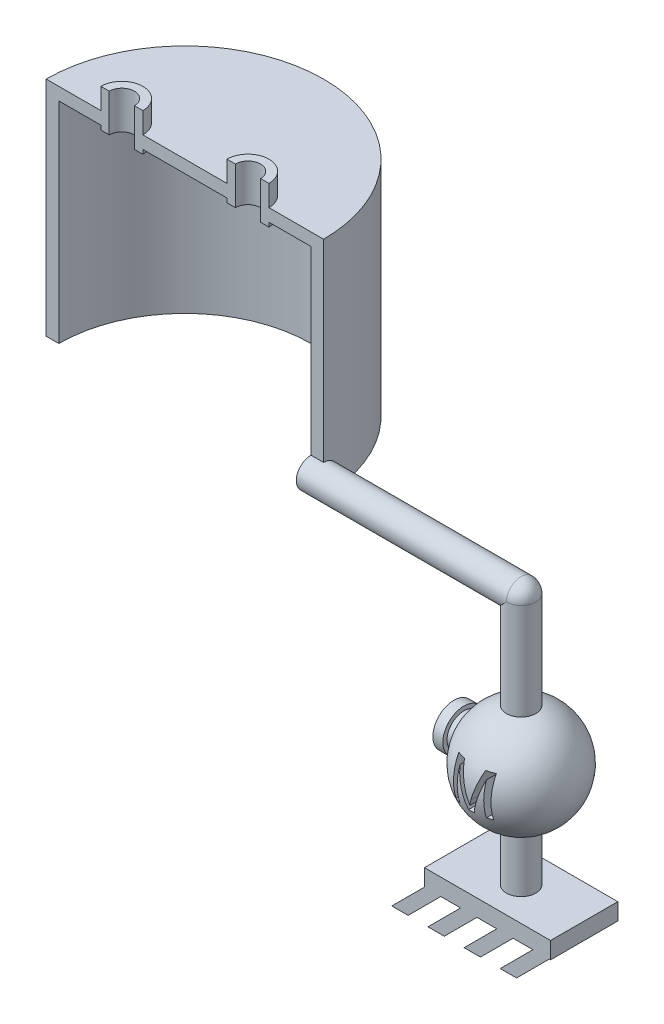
from build123d import *

# Parameters (mm, degrees)
ENL_V_MAT_EXTRU_1_DEPTH = 16.127679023
ESQUISSE3_R             = 3.5
EXTRUSION1_DEPTH        = 25
EXTRUSION2_START        = 35
ESQUISSE4_R             = 3.5
EXTRUSION2_DEPTH        = 35
ESQUISSE5_R             = 3.5
EXTRUSION3_DEPTH        = 50
R_VOLUTION3_ANGLE       = 180
EXTRUSION4_DEPTH        = 5
EXTRUSION4_DEPTH_BACK   = 4
ESQUISSE9_R             = 3
ENL_V_MAT_EXTRU_2_DEPTH = 17
ESQUISSE10_W            = 30
ESQUISSE10_H            = 16
EXTRUSION5_DEPTH        = 4
EXTRUSION6_DEPTH        = 16


with BuildPart() as part:
    # Esquisse1 → R_volution1 (revolve)
    with BuildSketch(Plane.XY, mode=Mode.PRIVATE) as r_volution1_sk:
        with BuildLine():
            Line((-11.842719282, 4), (-13.623944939, 4))
            Line((-13.623944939, 4), (-13.623944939, 5))
            Line((-13.623944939, 5), (-16, 5))
            Line((-16, 5), (-16, 0))
            Line((-16, 0), (12.5, 0))
            ThreePointArc((12.5, 0), (2.026821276, 12.33458534), (-11.842719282, 4))
        make_face()
    revolve(r_volution1_sk.sketch.rotate(Axis((16.096494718, 0, 0), (-1, 0, 0)), 90), axis=Axis((16.096494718, 0, 0), (-1, 0, 0)))

    # Esquisse2 → Enl_v. mat.-Extru.1 (cut)
    with BuildSketch(Plane.XY):
        with BuildLine():
            Line((-4.401688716, -3.923496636), (-4.401688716, 5.32245063))
            Line((-4.401688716, 5.32245063), (-2.440258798, 5.32245063))
            Line((-2.440258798, 5.32245063), (-0.373256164, -1.165640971))
            add(Edge.make_bspline(
                [(-0.373256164, -1.165640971), (-0.350508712, -1.239139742), (-0.306516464, -1.381282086), (-0.24128118, -1.58654871), (-0.181928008, -1.777298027), (-0.12847113, -1.954137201), (-0.078023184, -2.116188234), (-0.034343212, -2.264780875), (0.007416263, -2.398263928), (0.031889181, -2.483096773), (0.043478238, -2.523269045)],
                knots=[0, 0, 0, 0, 1.300204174, 2.514519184, 3.639827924, 4.676153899, 5.636536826, 6.507959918, 7.293450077, 8, 8, 8, 8], degree=3))
            add(Edge.make_bspline(
                [(0.043478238, -2.523269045), (0.056385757, -2.479417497), (0.083853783, -2.3860986), (0.128383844, -2.239370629), (0.175765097, -2.07699962), (0.232465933, -1.901776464), (0.291569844, -1.71095246), (0.353607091, -1.504686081), (0.425165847, -1.28503665), (0.472720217, -1.132969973), (0.497255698, -1.054511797)],
                knots=[0, 0, 0, 0, 0.713638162, 1.518667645, 2.393860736, 3.354087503, 4.393659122, 5.512594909, 6.716633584, 8, 8, 8, 8], degree=3))
            Line((0.497255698, -1.054511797), (2.54388465, 5.32245063))
            Line((2.54388465, 5.32245063), (4.488645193, 5.32245063))
            Line((4.488645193, 5.32245063), (4.488645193, -3.923496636))
            Line((4.488645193, -3.923496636), (3.184729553, -3.923496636))
            Line((3.184729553, -3.923496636), (3.184729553, 3.899997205))
            Line((3.184729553, 3.899997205), (0.717661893, -3.923496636))
            Line((0.717661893, -3.923496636), (-0.64552264, -3.923496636))
            Line((-0.64552264, -3.923496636), (-3.097773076, 3.899997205))
            Line((-3.097773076, 3.899997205), (-3.097773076, -3.923496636))
            Line((-3.097773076, -3.923496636), (-4.401688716, -3.923496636))
        make_face()
    extrude(amount=ENL_V_MAT_EXTRU_1_DEPTH, mode=Mode.SUBTRACT)

    # Esquisse3 → Extrusion1 (add)
    with BuildSketch(Plane(origin=(0, 0, 0), x_dir=(1, 0, 0), z_dir=(0, 1, 0))):
        with Locations(Location((0, 0, 0), (0, 0, 270))):
            Circle(ESQUISSE3_R)
    extrude(amount=-EXTRUSION1_DEPTH)

    # Esquisse4 → Extrusion2 (add)
    with BuildSketch(Plane(origin=(0, 0, 0), x_dir=(1, 0, 0), z_dir=(0, 1, 0)).offset(EXTRUSION2_START)):
        with Locations(Location((0, 0, 0), (0, 0, 270))):
            Circle(ESQUISSE4_R)
    extrude(amount=-EXTRUSION2_DEPTH)

    # Esquisse5 → Extrusion3 (add)
    with BuildSketch(Plane(origin=(0, 0, 0), x_dir=(0, 0, -1), z_dir=(1, 0, 0))):
        with Locations((0, 35)):
            Circle(ESQUISSE5_R)
    extrude(amount=-EXTRUSION3_DEPTH)

    # Esquisse6 → R_volution3 (revolve)
    with BuildSketch(Plane.XY):
        Polygon((-50, 31.5), (-47, 31.5), (-47, 84.5), (-50, 84.5), (-80, 84.5), (-80, 81.5), (-50, 81.5), align=None)
    revolve(axis=Axis((-80, 79.090381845, 0), (0, 1, 0)), revolution_arc=R_VOLUTION3_ANGLE)

    # Esquisse7 → Extrusion4 (add, two sides: drawn at the far end of the back side and taken through both)
    with BuildSketch(Plane(origin=(0, 84.5, 0), x_dir=(-1, 0, 0), z_dir=(0, 1, 0)).offset(-EXTRUSION4_DEPTH_BACK)):
        with BuildLine():
            Line((100, 0), (90, 0))
            ThreePointArc((90, 0), (95, -5), (100, 0))
        make_face()
        with BuildLine():
            Line((70, 0), (60, 0))
            ThreePointArc((60, 0), (65, -5), (70, 0))
        make_face()
    extrude(amount=EXTRUSION4_DEPTH + EXTRUSION4_DEPTH_BACK)

    # Esquisse9 → Enl_v. mat.-Extru.2 (cut)
    with BuildSketch(Plane(origin=(0, 89.5, 0), x_dir=(-1, 0, 0), z_dir=(0, 1, 0))):
        with Locations((65, 0)):
            Circle(ESQUISSE9_R)
        with Locations((95, 0)):
            Circle(ESQUISSE9_R)
    extrude(amount=-ENL_V_MAT_EXTRU_2_DEPTH, mode=Mode.SUBTRACT)

    # Esquisse10 → Extrusion5 (add)
    with BuildSketch(Plane.XZ.offset(25)):
        Rectangle(ESQUISSE10_W, ESQUISSE10_H)
    extrude(amount=EXTRUSION5_DEPTH)

    # Esquisse11 → Extrusion6 (add)
    with BuildSketch(Plane.XY.offset(8)):
        Polygon((-15, -29), (-22.776409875, -36.776409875), (-18.888204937, -36.776409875), (-11.111795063, -29), align=None)
        Polygon((-2.511795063, -29), (-6.4, -29), (-14.176409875, -36.776409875), (-10.288204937, -36.776409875), align=None)
        Polygon((6.088204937, -29), (2.2, -29), (-5.576409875, -36.776409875), (-1.688204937, -36.776409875), align=None)
        Polygon((14.688204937, -29), (10.8, -29), (3.023590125, -36.776409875), (6.911795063, -36.776409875), align=None)
    extrude(amount=-EXTRUSION6_DEPTH)

    # Esquisse12 → R_volution4 (revolve)
    with BuildSketch(Plane(origin=(0, 35, 0), x_dir=(-1, 0, 0), z_dir=(0, 1, 0))):
        with BuildLine():
            Line((0, -3.5), (0, 3.5))
            ThreePointArc((0, 3.5), (-3.5, 0), (0, -3.5))
        make_face()
    revolve(axis=Axis((0, 35, -12.72494358), (0, 0, 1)))


solid = part.part
